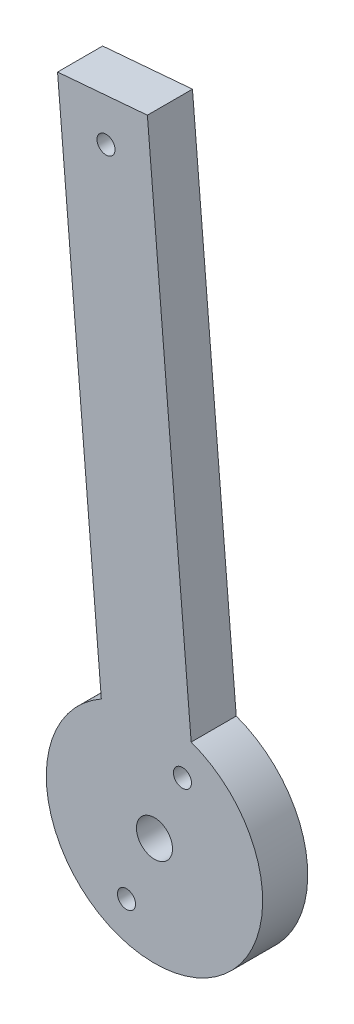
ISO-10303-21;
HEADER;
FILE_DESCRIPTION(('STEP AP214'),'2;1');
FILE_NAME('part.step','',(''),(''),'','','');
FILE_SCHEMA(('AUTOMOTIVE_DESIGN { 1 0 10303 214 1 1 1 1 }'));
ENDSEC;
DATA;
#1=APPLICATION_CONTEXT('core data for automotive mechanical design processes');
#2=APPLICATION_PROTOCOL_DEFINITION('international standard','automotive_design',2000,#1);
#3=PRODUCT_CONTEXT('',#1,'mechanical');
#4=PRODUCT('Part','Part','',(#3));
#5=PRODUCT_RELATED_PRODUCT_CATEGORY('part','',(#4));
#6=PRODUCT_DEFINITION_FORMATION('','',#4);
#7=PRODUCT_DEFINITION_CONTEXT('part definition',#1,'design');
#8=PRODUCT_DEFINITION('design','',#6,#7);
#9=PRODUCT_DEFINITION_SHAPE('','',#8);
#10=(LENGTH_UNIT() NAMED_UNIT(*) SI_UNIT(.MILLI.,.METRE.));
#11=(NAMED_UNIT(*) PLANE_ANGLE_UNIT() SI_UNIT($,.RADIAN.));
#12=(NAMED_UNIT(*) SI_UNIT($,.STERADIAN.) SOLID_ANGLE_UNIT());
#13=UNCERTAINTY_MEASURE_WITH_UNIT(LENGTH_MEASURE(1.E-05),#10,'distance_accuracy_value','');
#14=(GEOMETRIC_REPRESENTATION_CONTEXT(3) GLOBAL_UNCERTAINTY_ASSIGNED_CONTEXT((#13)) GLOBAL_UNIT_ASSIGNED_CONTEXT((#10,
#11,#12)) REPRESENTATION_CONTEXT('',''));
#15=CARTESIAN_POINT('',(0.,0.,0.));
#16=DIRECTION('',(0.,0.,1.));
#17=DIRECTION('',(1.,0.,0.));
#18=AXIS2_PLACEMENT_3D('',#15,#16,#17);
#19=CARTESIAN_POINT('',(0.,0.,5.));
#20=DIRECTION('',(0.,0.,-1.));
#21=DIRECTION('',(-1.,0.,0.));
#22=AXIS2_PLACEMENT_3D('',#19,#20,#21);
#23=CYLINDRICAL_SURFACE('',#22,12.);
#24=CARTESIAN_POINT('',(0.,0.,0.));
#25=DIRECTION('',(0.,0.,1.));
#26=DIRECTION('',(1.,0.,0.));
#27=AXIS2_PLACEMENT_3D('',#24,#25,#26);
#28=CIRCLE('',#27,12.);
#29=CARTESIAN_POINT('',(-5.89579257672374,10.4517763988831,0.));
#30=VERTEX_POINT('',#29);
#31=CARTESIAN_POINT('',(4.06909511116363,11.2890418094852,0.));
#32=VERTEX_POINT('',#31);
#33=EDGE_CURVE('E99',#30,#32,#28,.T.);
#34=ORIENTED_EDGE('',*,*,#33,.T.);
#35=DIRECTION('',(0.,0.,-1.));
#36=VECTOR('',#35,1.);
#37=CARTESIAN_POINT('',(4.06909511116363,11.2890418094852,5.));
#38=LINE('',#37,#36);
#39=CARTESIAN_POINT('',(4.06909511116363,11.2890418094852,5.));
#40=VERTEX_POINT('',#39);
#41=EDGE_CURVE('E11',#40,#32,#38,.T.);
#42=ORIENTED_EDGE('',*,*,#41,.F.);
#43=CARTESIAN_POINT('',(0.,0.,5.));
#44=DIRECTION('',(0.,0.,1.));
#45=DIRECTION('',(1.,0.,0.));
#46=AXIS2_PLACEMENT_3D('',#43,#44,#45);
#47=CIRCLE('',#46,12.);
#48=CARTESIAN_POINT('',(-5.89579257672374,10.4517763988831,5.));
#49=VERTEX_POINT('',#48);
#50=EDGE_CURVE('E86',#49,#40,#47,.T.);
#51=ORIENTED_EDGE('',*,*,#50,.F.);
#52=DIRECTION('',(0.,0.,-1.));
#53=VECTOR('',#52,1.);
#54=CARTESIAN_POINT('',(-5.89579257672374,10.4517763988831,5.));
#55=LINE('',#54,#53);
#56=EDGE_CURVE('E95',#49,#30,#55,.T.);
#57=ORIENTED_EDGE('',*,*,#56,.T.);
#58=EDGE_LOOP('',(#34,#42,#51,#57));
#59=FACE_BOUND('',#58,.T.);
#60=ADVANCED_FACE('F33',(#59),#23,.T.);
#61=CARTESIAN_POINT('',(-0.787044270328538,69.0853903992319,5.));
#62=DIRECTION('',(-0.996488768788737,-0.0837265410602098,0.));
#63=DIRECTION('',(0.0837265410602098,-0.996488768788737,0.));
#64=AXIS2_PLACEMENT_3D('',#61,#62,#63);
#65=PLANE('',#64);
#66=DIRECTION('',(-0.0837265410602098,0.996488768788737,0.));
#67=VECTOR('',#66,1.);
#68=CARTESIAN_POINT('',(-0.787044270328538,69.0853903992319,0.));
#69=LINE('',#68,#67);
#70=CARTESIAN_POINT('',(-0.787044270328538,69.0853903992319,0.));
#71=VERTEX_POINT('',#70);
#72=EDGE_CURVE('E90',#32,#71,#69,.T.);
#73=ORIENTED_EDGE('',*,*,#72,.T.);
#74=DIRECTION('',(0.,0.,-1.));
#75=VECTOR('',#74,1.);
#76=CARTESIAN_POINT('',(-0.787044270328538,69.0853903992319,5.));
#77=LINE('',#76,#75);
#78=CARTESIAN_POINT('',(-0.787044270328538,69.0853903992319,5.));
#79=VERTEX_POINT('',#78);
#80=EDGE_CURVE('E42',#79,#71,#77,.T.);
#81=ORIENTED_EDGE('',*,*,#80,.F.);
#82=DIRECTION('',(-0.0837265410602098,0.996488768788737,0.));
#83=VECTOR('',#82,1.);
#84=CARTESIAN_POINT('',(-0.787044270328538,69.0853903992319,5.));
#85=LINE('',#84,#83);
#86=EDGE_CURVE('E81',#40,#79,#85,.T.);
#87=ORIENTED_EDGE('',*,*,#86,.F.);
#88=ORIENTED_EDGE('',*,*,#41,.T.);
#89=EDGE_LOOP('',(#73,#81,#87,#88));
#90=FACE_BOUND('',#89,.T.);
#91=ADVANCED_FACE('F89',(#90),#65,.F.);
#92=CARTESIAN_POINT('',(-10.7519319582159,68.2481249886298,5.));
#93=DIRECTION('',(0.0837265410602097,-0.996488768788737,0.));
#94=DIRECTION('',(0.996488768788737,0.0837265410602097,0.));
#95=AXIS2_PLACEMENT_3D('',#92,#93,#94);
#96=PLANE('',#95);
#97=DIRECTION('',(-0.996488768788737,-0.0837265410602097,0.));
#98=VECTOR('',#97,1.);
#99=CARTESIAN_POINT('',(-10.7519319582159,68.2481249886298,0.));
#100=LINE('',#99,#98);
#101=CARTESIAN_POINT('',(-10.7519319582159,68.2481249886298,0.));
#102=VERTEX_POINT('',#101);
#103=EDGE_CURVE('E68',#71,#102,#100,.T.);
#104=ORIENTED_EDGE('',*,*,#103,.T.);
#105=DIRECTION('',(0.,0.,-1.));
#106=VECTOR('',#105,1.);
#107=CARTESIAN_POINT('',(-10.7519319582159,68.2481249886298,5.));
#108=LINE('',#107,#106);
#109=CARTESIAN_POINT('',(-10.7519319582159,68.2481249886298,5.));
#110=VERTEX_POINT('',#109);
#111=EDGE_CURVE('E91',#110,#102,#108,.T.);
#112=ORIENTED_EDGE('',*,*,#111,.F.);
#113=DIRECTION('',(-0.996488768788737,-0.0837265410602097,0.));
#114=VECTOR('',#113,1.);
#115=CARTESIAN_POINT('',(-10.7519319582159,68.2481249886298,5.));
#116=LINE('',#115,#114);
#117=EDGE_CURVE('E84',#79,#110,#116,.T.);
#118=ORIENTED_EDGE('',*,*,#117,.F.);
#119=ORIENTED_EDGE('',*,*,#80,.T.);
#120=EDGE_LOOP('',(#104,#112,#118,#119));
#121=FACE_BOUND('',#120,.T.);
#122=ADVANCED_FACE('F93',(#121),#96,.F.);
#123=CARTESIAN_POINT('',(-5.89579257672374,10.4517763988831,5.));
#124=DIRECTION('',(0.996488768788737,0.0837265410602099,0.));
#125=DIRECTION('',(-0.0837265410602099,0.996488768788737,0.));
#126=AXIS2_PLACEMENT_3D('',#123,#124,#125);
#127=PLANE('',#126);
#128=DIRECTION('',(0.0837265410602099,-0.996488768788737,0.));
#129=VECTOR('',#128,1.);
#130=CARTESIAN_POINT('',(-5.89579257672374,10.4517763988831,0.));
#131=LINE('',#130,#129);
#132=EDGE_CURVE('E74',#102,#30,#131,.T.);
#133=ORIENTED_EDGE('',*,*,#132,.T.);
#134=ORIENTED_EDGE('',*,*,#56,.F.);
#135=DIRECTION('',(0.0837265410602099,-0.996488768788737,0.));
#136=VECTOR('',#135,1.);
#137=CARTESIAN_POINT('',(-5.89579257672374,10.4517763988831,5.));
#138=LINE('',#137,#136);
#139=EDGE_CURVE('E51',#110,#49,#138,.T.);
#140=ORIENTED_EDGE('',*,*,#139,.F.);
#141=ORIENTED_EDGE('',*,*,#111,.T.);
#142=EDGE_LOOP('',(#133,#134,#140,#141));
#143=FACE_BOUND('',#142,.T.);
#144=ADVANCED_FACE('F136',(#143),#127,.F.);
#145=CARTESIAN_POINT('',(0.,0.,5.));
#146=DIRECTION('',(0.,0.,1.));
#147=DIRECTION('',(1.,0.,0.));
#148=AXIS2_PLACEMENT_3D('',#145,#146,#147);
#149=PLANE('',#148);
#150=CARTESIAN_POINT('',(-3.10466779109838,-7.37299382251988,5.));
#151=DIRECTION('',(0.,0.,1.));
#152=DIRECTION('',(1.,0.,0.));
#153=AXIS2_PLACEMENT_3D('',#150,#151,#152);
#154=CIRCLE('',#153,1.);
#155=CARTESIAN_POINT('',(-2.10466779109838,-7.37299382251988,5.));
#156=VERTEX_POINT('',#155);
#157=EDGE_CURVE('E121',#156,#156,#154,.T.);
#158=ORIENTED_EDGE('',*,*,#157,.F.);
#159=EDGE_LOOP('',(#158));
#160=FACE_BOUND('',#159,.T.);
#161=CARTESIAN_POINT('',(3.10466779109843,7.37299382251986,5.));
#162=DIRECTION('',(0.,0.,1.));
#163=DIRECTION('',(1.,0.,0.));
#164=AXIS2_PLACEMENT_3D('',#161,#162,#163);
#165=CIRCLE('',#164,1.);
#166=CARTESIAN_POINT('',(4.10466779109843,7.37299382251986,5.));
#167=VERTEX_POINT('',#166);
#168=EDGE_CURVE('E110',#167,#167,#165,.T.);
#169=ORIENTED_EDGE('',*,*,#168,.F.);
#170=EDGE_LOOP('',(#169));
#171=FACE_BOUND('',#170,.T.);
#172=CARTESIAN_POINT('',(-5.37479340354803,63.9692168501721,5.));
#173=DIRECTION('',(0.,0.,1.));
#174=DIRECTION('',(1.,0.,0.));
#175=AXIS2_PLACEMENT_3D('',#172,#173,#174);
#176=CIRCLE('',#175,1.);
#177=CARTESIAN_POINT('',(-4.37479340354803,63.9692168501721,5.));
#178=VERTEX_POINT('',#177);
#179=EDGE_CURVE('E109',#178,#178,#176,.T.);
#180=ORIENTED_EDGE('',*,*,#179,.F.);
#181=EDGE_LOOP('',(#180));
#182=FACE_BOUND('',#181,.T.);
#183=CARTESIAN_POINT('',(0.,0.,5.));
#184=DIRECTION('',(0.,0.,1.));
#185=DIRECTION('',(1.,0.,0.));
#186=AXIS2_PLACEMENT_3D('',#183,#184,#185);
#187=CIRCLE('',#186,2.);
#188=CARTESIAN_POINT('',(2.,0.,5.));
#189=VERTEX_POINT('',#188);
#190=EDGE_CURVE('E125',#189,#189,#187,.T.);
#191=ORIENTED_EDGE('',*,*,#190,.F.);
#192=EDGE_LOOP('',(#191));
#193=FACE_BOUND('',#192,.T.);
#194=ORIENTED_EDGE('',*,*,#50,.T.);
#195=ORIENTED_EDGE('',*,*,#86,.T.);
#196=ORIENTED_EDGE('',*,*,#117,.T.);
#197=ORIENTED_EDGE('',*,*,#139,.T.);
#198=EDGE_LOOP('',(#194,#195,#196,#197));
#199=FACE_BOUND('',#198,.T.);
#200=ADVANCED_FACE('F82',(#160,#171,#182,#193,#199),#149,.T.);
#201=CARTESIAN_POINT('',(0.,0.,0.));
#202=DIRECTION('',(0.,0.,1.));
#203=DIRECTION('',(1.,0.,0.));
#204=AXIS2_PLACEMENT_3D('',#201,#202,#203);
#205=PLANE('',#204);
#206=CARTESIAN_POINT('',(-3.10466779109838,-7.37299382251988,0.));
#207=DIRECTION('',(0.,0.,1.));
#208=DIRECTION('',(1.,0.,0.));
#209=AXIS2_PLACEMENT_3D('',#206,#207,#208);
#210=CIRCLE('',#209,1.);
#211=CARTESIAN_POINT('',(-2.10466779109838,-7.37299382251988,0.));
#212=VERTEX_POINT('',#211);
#213=EDGE_CURVE('E36',#212,#212,#210,.T.);
#214=ORIENTED_EDGE('',*,*,#213,.T.);
#215=EDGE_LOOP('',(#214));
#216=FACE_BOUND('',#215,.T.);
#217=CARTESIAN_POINT('',(3.10466779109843,7.37299382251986,0.));
#218=DIRECTION('',(0.,0.,1.));
#219=DIRECTION('',(1.,0.,0.));
#220=AXIS2_PLACEMENT_3D('',#217,#218,#219);
#221=CIRCLE('',#220,1.);
#222=CARTESIAN_POINT('',(4.10466779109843,7.37299382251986,0.));
#223=VERTEX_POINT('',#222);
#224=EDGE_CURVE('E107',#223,#223,#221,.T.);
#225=ORIENTED_EDGE('',*,*,#224,.T.);
#226=EDGE_LOOP('',(#225));
#227=FACE_BOUND('',#226,.T.);
#228=CARTESIAN_POINT('',(-5.37479340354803,63.9692168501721,0.));
#229=DIRECTION('',(0.,0.,1.));
#230=DIRECTION('',(1.,0.,0.));
#231=AXIS2_PLACEMENT_3D('',#228,#229,#230);
#232=CIRCLE('',#231,1.);
#233=CARTESIAN_POINT('',(-4.37479340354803,63.9692168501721,0.));
#234=VERTEX_POINT('',#233);
#235=EDGE_CURVE('E114',#234,#234,#232,.T.);
#236=ORIENTED_EDGE('',*,*,#235,.T.);
#237=EDGE_LOOP('',(#236));
#238=FACE_BOUND('',#237,.T.);
#239=CARTESIAN_POINT('',(0.,0.,0.));
#240=DIRECTION('',(0.,0.,1.));
#241=DIRECTION('',(1.,0.,0.));
#242=AXIS2_PLACEMENT_3D('',#239,#240,#241);
#243=CIRCLE('',#242,2.);
#244=CARTESIAN_POINT('',(2.,0.,0.));
#245=VERTEX_POINT('',#244);
#246=EDGE_CURVE('E102',#245,#245,#243,.T.);
#247=ORIENTED_EDGE('',*,*,#246,.T.);
#248=EDGE_LOOP('',(#247));
#249=FACE_BOUND('',#248,.T.);
#250=ORIENTED_EDGE('',*,*,#33,.F.);
#251=ORIENTED_EDGE('',*,*,#132,.F.);
#252=ORIENTED_EDGE('',*,*,#103,.F.);
#253=ORIENTED_EDGE('',*,*,#72,.F.);
#254=EDGE_LOOP('',(#250,#251,#252,#253));
#255=FACE_BOUND('',#254,.T.);
#256=ADVANCED_FACE('F135',(#216,#227,#238,#249,#255),#205,.F.);
#257=CARTESIAN_POINT('',(0.,0.,0.));
#258=DIRECTION('',(0.,0.,1.));
#259=DIRECTION('',(1.,0.,0.));
#260=AXIS2_PLACEMENT_3D('',#257,#258,#259);
#261=CYLINDRICAL_SURFACE('',#260,2.);
#262=ORIENTED_EDGE('',*,*,#246,.F.);
#263=EDGE_LOOP('',(#262));
#264=FACE_BOUND('',#263,.T.);
#265=ORIENTED_EDGE('',*,*,#190,.T.);
#266=EDGE_LOOP('',(#265));
#267=FACE_BOUND('',#266,.T.);
#268=ADVANCED_FACE('F132',(#264,#267),#261,.F.);
#269=CARTESIAN_POINT('',(-5.37479340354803,63.9692168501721,0.));
#270=DIRECTION('',(0.,0.,1.));
#271=DIRECTION('',(1.,0.,0.));
#272=AXIS2_PLACEMENT_3D('',#269,#270,#271);
#273=CYLINDRICAL_SURFACE('',#272,1.);
#274=ORIENTED_EDGE('',*,*,#235,.F.);
#275=EDGE_LOOP('',(#274));
#276=FACE_BOUND('',#275,.T.);
#277=ORIENTED_EDGE('',*,*,#179,.T.);
#278=EDGE_LOOP('',(#277));
#279=FACE_BOUND('',#278,.T.);
#280=ADVANCED_FACE('F176',(#276,#279),#273,.F.);
#281=CARTESIAN_POINT('',(3.10466779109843,7.37299382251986,-5.));
#282=DIRECTION('',(0.,0.,1.));
#283=DIRECTION('',(1.,0.,0.));
#284=AXIS2_PLACEMENT_3D('',#281,#282,#283);
#285=CYLINDRICAL_SURFACE('',#284,1.);
#286=ORIENTED_EDGE('',*,*,#168,.T.);
#287=EDGE_LOOP('',(#286));
#288=FACE_BOUND('',#287,.T.);
#289=ORIENTED_EDGE('',*,*,#224,.F.);
#290=EDGE_LOOP('',(#289));
#291=FACE_BOUND('',#290,.T.);
#292=ADVANCED_FACE('F185',(#288,#291),#285,.F.);
#293=CARTESIAN_POINT('',(-3.10466779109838,-7.37299382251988,-5.));
#294=DIRECTION('',(0.,0.,1.));
#295=DIRECTION('',(1.,0.,0.));
#296=AXIS2_PLACEMENT_3D('',#293,#294,#295);
#297=CYLINDRICAL_SURFACE('',#296,1.);
#298=ORIENTED_EDGE('',*,*,#157,.T.);
#299=EDGE_LOOP('',(#298));
#300=FACE_BOUND('',#299,.T.);
#301=ORIENTED_EDGE('',*,*,#213,.F.);
#302=EDGE_LOOP('',(#301));
#303=FACE_BOUND('',#302,.T.);
#304=ADVANCED_FACE('F204',(#300,#303),#297,.F.);
#305=CLOSED_SHELL('',(#60,#91,#122,#144,#200,#256,#268,#280,#292,#304));
#306=MANIFOLD_SOLID_BREP('B2',#305);
#307=ADVANCED_BREP_SHAPE_REPRESENTATION('',(#18,#306),#14);
#308=SHAPE_DEFINITION_REPRESENTATION(#9,#307);
ENDSEC;
END-ISO-10303-21;
